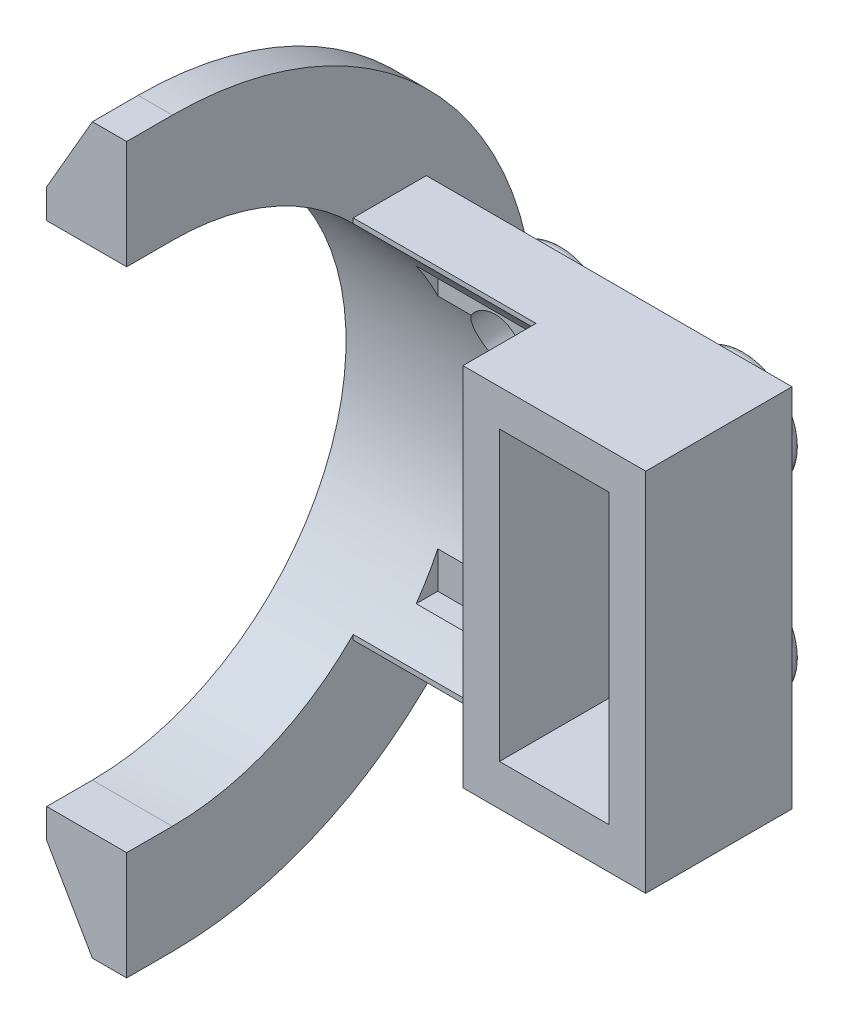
from build123d import *
from OCP.BRepFilletAPI import BRepFilletAPI_MakeChamfer

# Parameters (mm, degrees)
SKIZZE1_W                         = 16
SKIZZE1_H                         = 16
LINEAR_AUSTRAGEN1_DEPTH           = 3.2
SKIZZE2_W                         = 12.8
SKIZZE2_H                         = 12.8
SCHNITT_LINEAR_AUSTRAGEN1_DEPTH   = 2.1
SKIZZE4_R                         = 2.45
LINEAR_AUSTRAGEN3_DEPTH           = 1.9
VERRUNDUNG1_R                     = 0.2
SKIZZE9_R                         = 1.25
LINEAR_AUSTRAGEN5_DEPTH           = 1.8
SKIZZE9_2_R                       = 1.25
SCHNITT_LINEAR_AUSTRAGEN3_DEPTH   = 1.8
LINEARES_MUSTER3_COUNT            = 2
LINEARES_MUSTER3_PITCH            = 8
LINEARES_MUSTER3_COUNT_DIR2       = 2
LINEARES_MUSTER3_PITCH_DIR2       = 8
VERRUNDUNG1_OF_LINEARES_MUSTER3_R = 0.2
SKIZZE10_W                        = 8
SKIZZE10_H                        = 16
SKIZZE10_W_2                      = 4.8
SKIZZE10_H_2                      = 12.6
LINEAR_AUSTRAGEN6_DEPTH           = 5.3
LINEAR_AUSTRAGEN7_DEPTH           = 3.5
FASE1_SIZE                        = 2
FASE1_SIZE2                       = 3.464101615
SCHNITT_LINEAR_START              = -8.5
SCHNITT_LINEAR_AUSTRAGEN4_DEPTH   = 8.5


with BuildPart() as part:
    # Skizze1 → Linear austragen1 (new body)
    with BuildSketch(Plane.XY):
        with Locations((-8, -8)):
            Rectangle(SKIZZE1_W, SKIZZE1_H)
    extrude(amount=LINEAR_AUSTRAGEN1_DEPTH)

    # Skizze2 → Schnitt-Linear austragen1 (cut)
    with BuildSketch(Plane.XY.offset(3.2)):
        with Locations((-8, -8)):
            Rectangle(SKIZZE2_W, SKIZZE2_H)
    extrude(amount=-SCHNITT_LINEAR_AUSTRAGEN1_DEPTH, mode=Mode.SUBTRACT)

    # Skizze4 → Linear austragen3 (add)
    with BuildSketch(Plane(origin=(0, 0, 0), x_dir=(-1, 0, 0), z_dir=(0, 0, -1))):
        with Locations(Location((4, -4, 0), (0, 0, 180))):
            Circle(SKIZZE4_R)
    linear_austragen3 = extrude(amount=LINEAR_AUSTRAGEN3_DEPTH)

    # Verrundung1
    verrundung1_edges = [part.edges().sort_by_distance(p)[0] for p in [
        (-6.45, -4, -1.9),
    ]]
    fillet(verrundung1_edges, radius=VERRUNDUNG1_R)

    # Skizze9 → Linear austragen5 (add)
    with BuildSketch(Plane.XY.offset(1.1)):
        with Locations((-3.9, -3.9)):
            Circle(SKIZZE9_R)
    linear_austragen5 = extrude(amount=-LINEAR_AUSTRAGEN5_DEPTH)

    # Skizze9_2 → Schnitt-Linear austragen3 (cut)
    with BuildSketch(Plane.XY.offset(1.1)):
        with Locations((-3.9, -3.9)):
            Circle(SKIZZE9_2_R)
    schnitt_linear_austragen3 = extrude(amount=-SCHNITT_LINEAR_AUSTRAGEN3_DEPTH, mode=Mode.SUBTRACT)

    # Lineares Muster3: Linear austragen3, Linear austragen5, Schnitt-Linear austragen3 2 × 2
    with Locations(*[(-j * LINEARES_MUSTER3_PITCH_DIR2, -i * LINEARES_MUSTER3_PITCH, 0) for i in range(LINEARES_MUSTER3_COUNT) for j in range(LINEARES_MUSTER3_COUNT_DIR2) if (i, j) != (0, 0)]):
        add(linear_austragen3)
        add(linear_austragen5)
        add(schnitt_linear_austragen3, mode=Mode.SUBTRACT)

    # Verrundung1 of Lineares Muster3
    verrundung1_of_lineares_muster3_edges = [part.edges().sort_by_distance(p)[0] for p in [
        (-14.45, -4, -1.9),
        (-6.45, -12, -1.9),
        (-14.45, -12, -1.9),
    ]]
    fillet(verrundung1_of_lineares_muster3_edges, radius=VERRUNDUNG1_OF_LINEARES_MUSTER3_R)

    # Skizze10 → Linear austragen6 (add)
    with BuildSketch(Plane.XY.offset(1.1)):
        with Locations((-4, -8)):
            Rectangle(SKIZZE10_W, SKIZZE10_H)
        with Locations((-4, -7.9)):
            Rectangle(SKIZZE10_W_2, SKIZZE10_H_2, mode=Mode.SUBTRACT)
    extrude(amount=LINEAR_AUSTRAGEN6_DEPTH)

    # Skizze14 → Linear austragen7 (add)
    with BuildSketch(Plane.ZY.offset(16)):
        with BuildLine():
            Line((11.112909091, 7.85), (13.112909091, 7.85))
            Line((13.112909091, 7.85), (13.112909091, 3.1))
            Line((13.112909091, 3.1), (11.112909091, 3.1))
            ThreePointArc((11.112909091, 3.1), (0.012909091, -8), (11.112909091, -19.1))
            Line((11.112909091, -19.1), (13.112909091, -19.1))
            Line((13.112909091, -19.1), (13.112909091, -23.85))
            Line((13.112909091, -23.85), (11.112909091, -23.85))
            ThreePointArc((11.112909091, -23.85), (-4.737090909, -8), (11.112909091, 7.85))
        make_face()
    extrude(amount=LINEAR_AUSTRAGEN7_DEPTH)

    # Fase1: one chamfer whose edges measure the first distance from different faces: ONE call of the kernel's chamfer builder (chamfer() names one face for all edges)
    fase1_edges_1 = [part.edges().sort_by_distance(p)[0] for p in [
        (-19.5, -8, -4.737090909),
    ]]
    fase1_side_1 = [part.faces().sort_by_distance(p)[0] for p in [
        (-17.75, -8, -4.737090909),
    ]]
    fase1_edges_2 = [part.edges().sort_by_distance(p)[0] for p in [
        (-19.5, -23.85, 12.112909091),
    ]]
    fase1_side_2 = [part.faces().sort_by_distance(p)[0] for p in [
        (-17.75, -23.85, 12.112909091),
    ]]
    fase1_edges_3 = [part.edges().sort_by_distance(p)[0] for p in [
        (-19.5, 7.85, 12.112909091),
    ]]
    fase1_side_3 = [part.faces().sort_by_distance(p)[0] for p in [
        (-17.75, 7.85, 12.112909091),
    ]]
    fase1 = BRepFilletAPI_MakeChamfer(part.part.solid().wrapped)
    for e in fase1_edges_1:
        fase1.Add(FASE1_SIZE, FASE1_SIZE2, e.wrapped, fase1_side_1[0].wrapped)  # the first distance lies on this face
    for e in fase1_edges_2:
        fase1.Add(FASE1_SIZE, FASE1_SIZE2, e.wrapped, fase1_side_2[0].wrapped)  # the first distance lies on this face
    for e in fase1_edges_3:
        fase1.Add(FASE1_SIZE, FASE1_SIZE2, e.wrapped, fase1_side_3[0].wrapped)  # the first distance lies on this face
    add(Compound.cast(fase1.Shape()), mode=Mode.REPLACE)

    # Skizze16 → Schnitt-Linear austragen4 (cut)
    with BuildSketch(Plane.ZY.offset(16).offset(SCHNITT_LINEAR_START)):
        with BuildLine():
            Line((3.2, -0.215665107), (3.2, -15.784334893))
            ThreePointArc((3.2, -15.784334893), (0.012909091, -8), (3.2, -0.215665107))
        make_face()
    extrude(amount=SCHNITT_LINEAR_AUSTRAGEN4_DEPTH, mode=Mode.SUBTRACT)


solid = part.part
